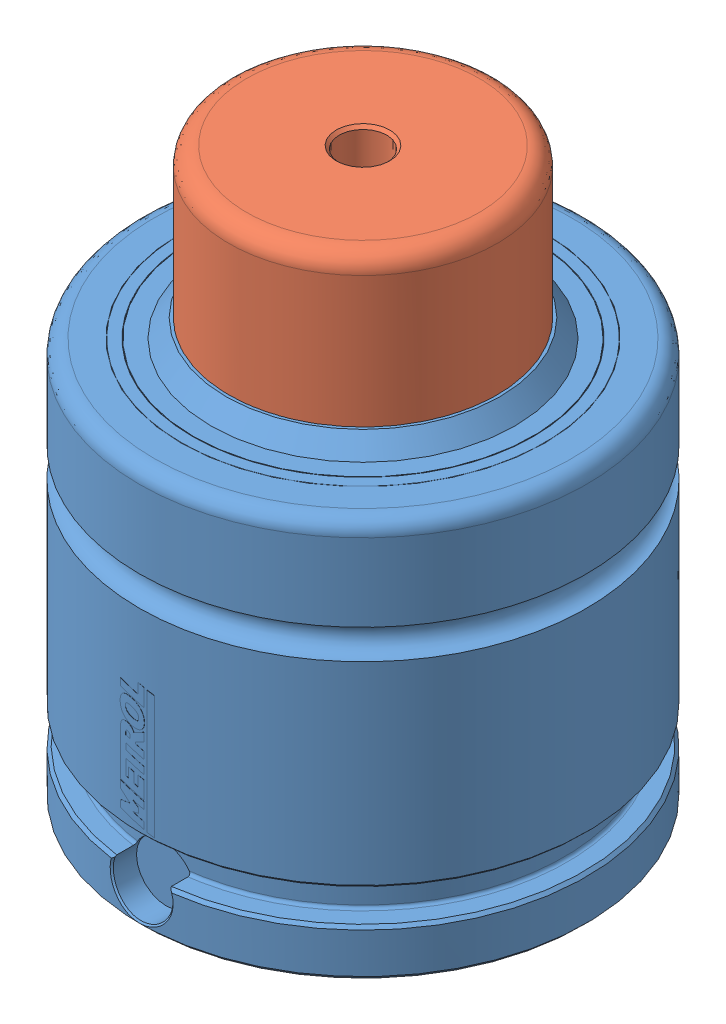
SolidWorks assembly EX2400-025.SLDASM, configuration Default (file format 7000). Lengths in mm.
Overall size (75 95 75.1).
2 component instances, 2 part files, 5 mates.
Components (placement in the parent):
- EX-2400 Body-1: EX-2400 Body.SLDPRT [EX-2500-025] x (0 0 1) z (0 -1 0) size (75.1 75 70)
- EX-2400 Piston-1: EX-2400 Piston.SLDPRT [EX-2500-025] at (0 52 0) x (-0.999345 0 -0.036175) z (0 -1 0) size (60 60 43)
Mates (geometry in assembly coordinates):
- Concentric1: concentric anti-aligned: cylinder of EX-2400 Body-1 through (0 0 0) axis (0 -1 0) radius 22.5; cylinder of EX-2400 Piston-1 through (0 83.6906 0) axis (0 1 0) radius 22.5
- LimitDistance1: limit distance anti-aligned: plane of EX-2400 Body-1 through (-22.5 57 0) normal (0 -1 0); plane of EX-2400 Piston-1 through (1.0853 57 -29.9804) normal (0 1 0)
- Coincident1: coincident anti-aligned: plane of EX-2400 Body-1 through (0 0 0) normal (0 -1 0); plane of assembly through (0 0 0) normal (0 1 0)
- Coincident3: coincident aligned: plane of EX-2400 Body-1; plane of assembly through (0 0 0) normal (0 0 1)
- Coincident4: coincident anti-aligned: plane of EX-2400 Body-1; plane of assembly through (0 0 0) normal (1 0 0)
